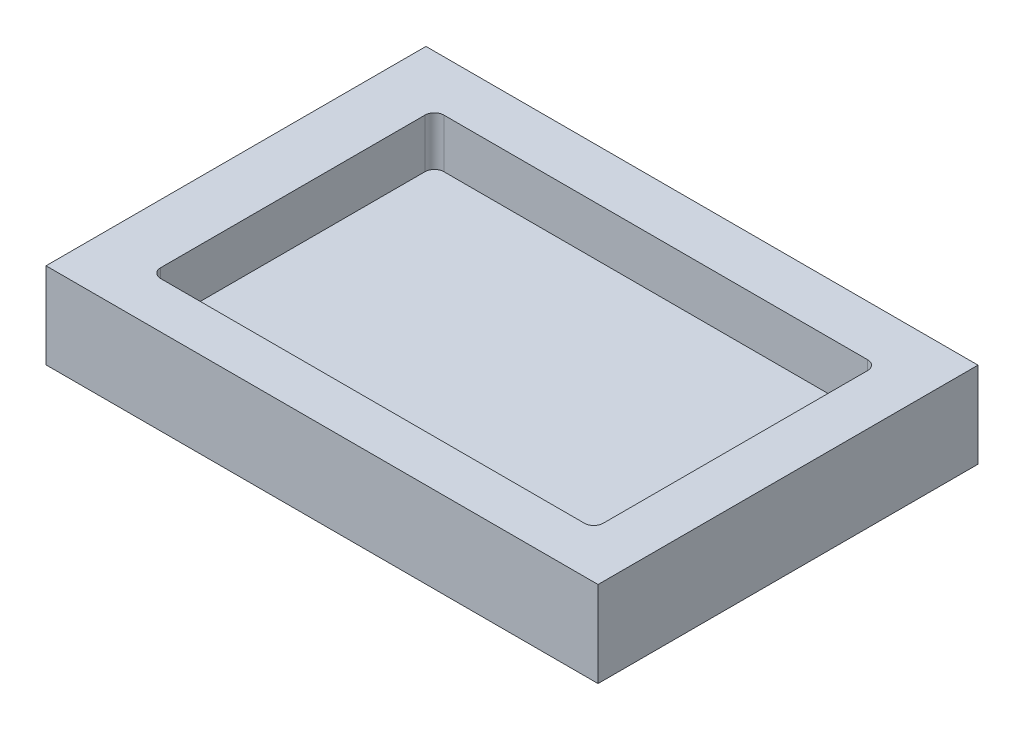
ISO-10303-21;
HEADER;
FILE_DESCRIPTION(('STEP AP214'),'2;1');
FILE_NAME('part.step','',(''),(''),'','','');
FILE_SCHEMA(('AUTOMOTIVE_DESIGN { 1 0 10303 214 1 1 1 1 }'));
ENDSEC;
DATA;
#1=APPLICATION_CONTEXT('core data for automotive mechanical design processes');
#2=APPLICATION_PROTOCOL_DEFINITION('international standard','automotive_design',2000,#1);
#3=PRODUCT_CONTEXT('',#1,'mechanical');
#4=PRODUCT('Part','Part','',(#3));
#5=PRODUCT_RELATED_PRODUCT_CATEGORY('part','',(#4));
#6=PRODUCT_DEFINITION_FORMATION('','',#4);
#7=PRODUCT_DEFINITION_CONTEXT('part definition',#1,'design');
#8=PRODUCT_DEFINITION('design','',#6,#7);
#9=PRODUCT_DEFINITION_SHAPE('','',#8);
#10=(LENGTH_UNIT() NAMED_UNIT(*) SI_UNIT(.MILLI.,.METRE.));
#11=(NAMED_UNIT(*) PLANE_ANGLE_UNIT() SI_UNIT($,.RADIAN.));
#12=(NAMED_UNIT(*) SI_UNIT($,.STERADIAN.) SOLID_ANGLE_UNIT());
#13=UNCERTAINTY_MEASURE_WITH_UNIT(LENGTH_MEASURE(1.E-05),#10,'distance_accuracy_value','');
#14=(GEOMETRIC_REPRESENTATION_CONTEXT(3) GLOBAL_UNCERTAINTY_ASSIGNED_CONTEXT((#13)) GLOBAL_UNIT_ASSIGNED_CONTEXT((#10,
#11,#12)) REPRESENTATION_CONTEXT('',''));
#15=CARTESIAN_POINT('',(0.,0.,0.));
#16=DIRECTION('',(0.,0.,1.));
#17=DIRECTION('',(1.,0.,0.));
#18=AXIS2_PLACEMENT_3D('',#15,#16,#17);
#19=CARTESIAN_POINT('',(-67.9067800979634,23.114,-54.8301366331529));
#20=DIRECTION('',(1.,0.,0.));
#21=DIRECTION('',(0.,0.,-1.));
#22=AXIS2_PLACEMENT_3D('',#19,#20,#21);
#23=PLANE('',#22);
#24=DIRECTION('',(0.,0.,1.));
#25=VECTOR('',#24,1.);
#26=CARTESIAN_POINT('',(-67.9067800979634,0.,-54.8301366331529));
#27=LINE('',#26,#25);
#28=CARTESIAN_POINT('',(-67.9067800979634,0.,-54.8301366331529));
#29=VERTEX_POINT('',#28);
#30=CARTESIAN_POINT('',(-67.9067800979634,0.,47.4888631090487));
#31=VERTEX_POINT('',#30);
#32=EDGE_CURVE('E123',#29,#31,#27,.T.);
#33=ORIENTED_EDGE('',*,*,#32,.T.);
#34=DIRECTION('',(0.,-1.,0.));
#35=VECTOR('',#34,1.);
#36=CARTESIAN_POINT('',(-67.9067800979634,23.114,47.4888631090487));
#37=LINE('',#36,#35);
#38=CARTESIAN_POINT('',(-67.9067800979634,23.114,47.4888631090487));
#39=VERTEX_POINT('',#38);
#40=EDGE_CURVE('E130',#39,#31,#37,.T.);
#41=ORIENTED_EDGE('',*,*,#40,.F.);
#42=DIRECTION('',(0.,0.,1.));
#43=VECTOR('',#42,1.);
#44=CARTESIAN_POINT('',(-67.9067800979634,23.114,-54.8301366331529));
#45=LINE('',#44,#43);
#46=CARTESIAN_POINT('',(-67.9067800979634,23.114,-54.8301366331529));
#47=VERTEX_POINT('',#46);
#48=EDGE_CURVE('E152',#47,#39,#45,.T.);
#49=ORIENTED_EDGE('',*,*,#48,.F.);
#50=DIRECTION('',(0.,-1.,0.));
#51=VECTOR('',#50,1.);
#52=CARTESIAN_POINT('',(-67.9067800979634,23.114,-54.8301366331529));
#53=LINE('',#52,#51);
#54=EDGE_CURVE('E141',#47,#29,#53,.T.);
#55=ORIENTED_EDGE('',*,*,#54,.T.);
#56=EDGE_LOOP('',(#33,#41,#49,#55));
#57=FACE_BOUND('',#56,.T.);
#58=ADVANCED_FACE('F31',(#57),#23,.F.);
#59=CARTESIAN_POINT('',(-67.9067800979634,23.114,47.4888631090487));
#60=DIRECTION('',(0.,0.,-1.));
#61=DIRECTION('',(-1.,0.,0.));
#62=AXIS2_PLACEMENT_3D('',#59,#60,#61);
#63=PLANE('',#62);
#64=DIRECTION('',(1.,0.,0.));
#65=VECTOR('',#64,1.);
#66=CARTESIAN_POINT('',(-67.9067800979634,0.,47.4888631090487));
#67=LINE('',#66,#65);
#68=CARTESIAN_POINT('',(80.7540087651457,0.,47.4888631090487));
#69=VERTEX_POINT('',#68);
#70=EDGE_CURVE('E118',#31,#69,#67,.T.);
#71=ORIENTED_EDGE('',*,*,#70,.T.);
#72=DIRECTION('',(0.,-1.,0.));
#73=VECTOR('',#72,1.);
#74=CARTESIAN_POINT('',(80.7540087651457,23.114,47.4888631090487));
#75=LINE('',#74,#73);
#76=CARTESIAN_POINT('',(80.7540087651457,23.114,47.4888631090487));
#77=VERTEX_POINT('',#76);
#78=EDGE_CURVE('E137',#77,#69,#75,.T.);
#79=ORIENTED_EDGE('',*,*,#78,.F.);
#80=DIRECTION('',(1.,0.,0.));
#81=VECTOR('',#80,1.);
#82=CARTESIAN_POINT('',(-67.9067800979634,23.114,47.4888631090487));
#83=LINE('',#82,#81);
#84=EDGE_CURVE('E132',#39,#77,#83,.T.);
#85=ORIENTED_EDGE('',*,*,#84,.F.);
#86=ORIENTED_EDGE('',*,*,#40,.T.);
#87=EDGE_LOOP('',(#71,#79,#85,#86));
#88=FACE_BOUND('',#87,.T.);
#89=ADVANCED_FACE('F131',(#88),#63,.F.);
#90=CARTESIAN_POINT('',(80.7540087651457,23.114,-54.8301366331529));
#91=DIRECTION('',(-1.,0.,0.));
#92=DIRECTION('',(0.,0.,1.));
#93=AXIS2_PLACEMENT_3D('',#90,#91,#92);
#94=PLANE('',#93);
#95=DIRECTION('',(0.,0.,-1.));
#96=VECTOR('',#95,1.);
#97=CARTESIAN_POINT('',(80.7540087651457,0.,-54.8301366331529));
#98=LINE('',#97,#96);
#99=CARTESIAN_POINT('',(80.7540087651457,0.,-54.8301366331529));
#100=VERTEX_POINT('',#99);
#101=EDGE_CURVE('E124',#69,#100,#98,.T.);
#102=ORIENTED_EDGE('',*,*,#101,.T.);
#103=DIRECTION('',(0.,-1.,0.));
#104=VECTOR('',#103,1.);
#105=CARTESIAN_POINT('',(80.7540087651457,23.114,-54.8301366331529));
#106=LINE('',#105,#104);
#107=CARTESIAN_POINT('',(80.7540087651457,23.114,-54.8301366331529));
#108=VERTEX_POINT('',#107);
#109=EDGE_CURVE('E160',#108,#100,#106,.T.);
#110=ORIENTED_EDGE('',*,*,#109,.F.);
#111=DIRECTION('',(0.,0.,-1.));
#112=VECTOR('',#111,1.);
#113=CARTESIAN_POINT('',(80.7540087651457,23.114,-54.8301366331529));
#114=LINE('',#113,#112);
#115=EDGE_CURVE('E155',#77,#108,#114,.T.);
#116=ORIENTED_EDGE('',*,*,#115,.F.);
#117=ORIENTED_EDGE('',*,*,#78,.T.);
#118=EDGE_LOOP('',(#102,#110,#116,#117));
#119=FACE_BOUND('',#118,.T.);
#120=ADVANCED_FACE('F256',(#119),#94,.F.);
#121=CARTESIAN_POINT('',(-67.9067800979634,23.114,-54.8301366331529));
#122=DIRECTION('',(0.,0.,1.));
#123=DIRECTION('',(1.,0.,0.));
#124=AXIS2_PLACEMENT_3D('',#121,#122,#123);
#125=PLANE('',#124);
#126=DIRECTION('',(-1.,0.,0.));
#127=VECTOR('',#126,1.);
#128=CARTESIAN_POINT('',(-67.9067800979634,0.,-54.8301366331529));
#129=LINE('',#128,#127);
#130=EDGE_CURVE('E150',#100,#29,#129,.T.);
#131=ORIENTED_EDGE('',*,*,#130,.T.);
#132=ORIENTED_EDGE('',*,*,#54,.F.);
#133=DIRECTION('',(-1.,0.,0.));
#134=VECTOR('',#133,1.);
#135=CARTESIAN_POINT('',(-67.9067800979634,23.114,-54.8301366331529));
#136=LINE('',#135,#134);
#137=EDGE_CURVE('E157',#108,#47,#136,.T.);
#138=ORIENTED_EDGE('',*,*,#137,.F.);
#139=ORIENTED_EDGE('',*,*,#109,.T.);
#140=EDGE_LOOP('',(#131,#132,#138,#139));
#141=FACE_BOUND('',#140,.T.);
#142=ADVANCED_FACE('F260',(#141),#125,.F.);
#143=CARTESIAN_POINT('',(-67.9067800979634,23.114,47.4888631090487));
#144=DIRECTION('',(0.,1.,0.));
#145=DIRECTION('',(0.,0.,1.));
#146=AXIS2_PLACEMENT_3D('',#143,#144,#145);
#147=PLANE('',#146);
#148=DIRECTION('',(0.,0.,-1.));
#149=VECTOR('',#148,1.);
#150=CARTESIAN_POINT('',(67.1679686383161,23.114,-41.2286602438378));
#151=LINE('',#150,#149);
#152=CARTESIAN_POINT('',(67.1679686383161,23.114,32.4971221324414));
#153=VERTEX_POINT('',#152);
#154=CARTESIAN_POINT('',(67.1679686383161,23.114,-38.6886602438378));
#155=VERTEX_POINT('',#154);
#156=EDGE_CURVE('E199',#153,#155,#151,.T.);
#157=ORIENTED_EDGE('',*,*,#156,.F.);
#158=CARTESIAN_POINT('',(64.6279686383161,23.114,32.4971221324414));
#159=DIRECTION('',(0.,1.,0.));
#160=DIRECTION('',(0.,0.,1.));
#161=AXIS2_PLACEMENT_3D('',#158,#159,#160);
#162=CIRCLE('',#161,2.54);
#163=CARTESIAN_POINT('',(64.6279686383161,23.114,35.0371221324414));
#164=VERTEX_POINT('',#163);
#165=EDGE_CURVE('E192',#153,#164,#162,.F.);
#166=ORIENTED_EDGE('',*,*,#165,.T.);
#167=DIRECTION('',(1.,0.,0.));
#168=VECTOR('',#167,1.);
#169=CARTESIAN_POINT('',(67.1679686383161,23.114,35.0371221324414));
#170=LINE('',#169,#168);
#171=CARTESIAN_POINT('',(-49.4812691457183,23.114,35.0371221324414));
#172=VERTEX_POINT('',#171);
#173=EDGE_CURVE('E197',#172,#164,#170,.T.);
#174=ORIENTED_EDGE('',*,*,#173,.F.);
#175=CARTESIAN_POINT('',(-49.4812691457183,23.114,32.4971221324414));
#176=DIRECTION('',(0.,1.,0.));
#177=DIRECTION('',(0.,0.,1.));
#178=AXIS2_PLACEMENT_3D('',#175,#176,#177);
#179=CIRCLE('',#178,2.54);
#180=CARTESIAN_POINT('',(-52.0212691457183,23.114,32.4971221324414));
#181=VERTEX_POINT('',#180);
#182=EDGE_CURVE('E38',#172,#181,#179,.F.);
#183=ORIENTED_EDGE('',*,*,#182,.T.);
#184=DIRECTION('',(0.,0.,1.));
#185=VECTOR('',#184,1.);
#186=CARTESIAN_POINT('',(-52.0212691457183,23.114,-41.2286602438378));
#187=LINE('',#186,#185);
#188=CARTESIAN_POINT('',(-52.0212691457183,23.114,-38.6886602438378));
#189=VERTEX_POINT('',#188);
#190=EDGE_CURVE('E208',#189,#181,#187,.T.);
#191=ORIENTED_EDGE('',*,*,#190,.F.);
#192=CARTESIAN_POINT('',(-49.4812691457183,23.114,-38.6886602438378));
#193=DIRECTION('',(0.,1.,0.));
#194=DIRECTION('',(0.,0.,1.));
#195=AXIS2_PLACEMENT_3D('',#192,#193,#194);
#196=CIRCLE('',#195,2.54);
#197=CARTESIAN_POINT('',(-49.4812691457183,23.114,-41.2286602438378));
#198=VERTEX_POINT('',#197);
#199=EDGE_CURVE('E11',#189,#198,#196,.F.);
#200=ORIENTED_EDGE('',*,*,#199,.T.);
#201=DIRECTION('',(-1.,0.,0.));
#202=VECTOR('',#201,1.);
#203=CARTESIAN_POINT('',(67.1679686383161,23.114,-41.2286602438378));
#204=LINE('',#203,#202);
#205=CARTESIAN_POINT('',(64.6279686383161,23.114,-41.2286602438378));
#206=VERTEX_POINT('',#205);
#207=EDGE_CURVE('E234',#206,#198,#204,.T.);
#208=ORIENTED_EDGE('',*,*,#207,.F.);
#209=CARTESIAN_POINT('',(64.6279686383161,23.114,-38.6886602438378));
#210=DIRECTION('',(0.,1.,0.));
#211=DIRECTION('',(0.,0.,1.));
#212=AXIS2_PLACEMENT_3D('',#209,#210,#211);
#213=CIRCLE('',#212,2.54);
#214=EDGE_CURVE('E190',#206,#155,#213,.F.);
#215=ORIENTED_EDGE('',*,*,#214,.T.);
#216=EDGE_LOOP('',(#157,#166,#174,#183,#191,#200,#208,#215));
#217=FACE_BOUND('',#216,.T.);
#218=ORIENTED_EDGE('',*,*,#48,.T.);
#219=ORIENTED_EDGE('',*,*,#84,.T.);
#220=ORIENTED_EDGE('',*,*,#115,.T.);
#221=ORIENTED_EDGE('',*,*,#137,.T.);
#222=EDGE_LOOP('',(#218,#219,#220,#221));
#223=FACE_BOUND('',#222,.T.);
#224=ADVANCED_FACE('F195',(#217,#223),#147,.T.);
#225=CARTESIAN_POINT('',(-67.9067800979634,0.,47.4888631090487));
#226=DIRECTION('',(0.,1.,0.));
#227=DIRECTION('',(0.,0.,1.));
#228=AXIS2_PLACEMENT_3D('',#225,#226,#227);
#229=PLANE('',#228);
#230=ORIENTED_EDGE('',*,*,#32,.F.);
#231=ORIENTED_EDGE('',*,*,#130,.F.);
#232=ORIENTED_EDGE('',*,*,#101,.F.);
#233=ORIENTED_EDGE('',*,*,#70,.F.);
#234=EDGE_LOOP('',(#230,#231,#232,#233));
#235=FACE_BOUND('',#234,.T.);
#236=ADVANCED_FACE('F120',(#235),#229,.F.);
#237=CARTESIAN_POINT('',(67.1679686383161,9.90600000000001,-41.2286602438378));
#238=DIRECTION('',(1.,0.,0.));
#239=DIRECTION('',(0.,0.,-1.));
#240=AXIS2_PLACEMENT_3D('',#237,#238,#239);
#241=PLANE('',#240);
#242=ORIENTED_EDGE('',*,*,#156,.T.);
#243=DIRECTION('',(0.,1.,0.));
#244=VECTOR('',#243,1.);
#245=CARTESIAN_POINT('',(67.1679686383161,9.90600000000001,-38.6886602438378));
#246=LINE('',#245,#244);
#247=CARTESIAN_POINT('',(67.1679686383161,9.90600000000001,-38.6886602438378));
#248=VERTEX_POINT('',#247);
#249=EDGE_CURVE('E171',#155,#248,#246,.F.);
#250=ORIENTED_EDGE('',*,*,#249,.T.);
#251=DIRECTION('',(0.,0.,-1.));
#252=VECTOR('',#251,1.);
#253=CARTESIAN_POINT('',(67.1679686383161,9.90600000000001,-41.2286602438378));
#254=LINE('',#253,#252);
#255=CARTESIAN_POINT('',(67.1679686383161,9.90600000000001,32.4971221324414));
#256=VERTEX_POINT('',#255);
#257=EDGE_CURVE('E207',#256,#248,#254,.T.);
#258=ORIENTED_EDGE('',*,*,#257,.F.);
#259=DIRECTION('',(0.,1.,0.));
#260=VECTOR('',#259,1.);
#261=CARTESIAN_POINT('',(67.1679686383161,23.114,32.4971221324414));
#262=LINE('',#261,#260);
#263=EDGE_CURVE('E168',#256,#153,#262,.T.);
#264=ORIENTED_EDGE('',*,*,#263,.T.);
#265=EDGE_LOOP('',(#242,#250,#258,#264));
#266=FACE_BOUND('',#265,.T.);
#267=ADVANCED_FACE('F218',(#266),#241,.F.);
#268=CARTESIAN_POINT('',(67.1679686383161,9.90600000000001,35.0371221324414));
#269=DIRECTION('',(0.,0.,1.));
#270=DIRECTION('',(1.,0.,0.));
#271=AXIS2_PLACEMENT_3D('',#268,#269,#270);
#272=PLANE('',#271);
#273=ORIENTED_EDGE('',*,*,#173,.T.);
#274=DIRECTION('',(0.,1.,0.));
#275=VECTOR('',#274,1.);
#276=CARTESIAN_POINT('',(64.6279686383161,9.90600000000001,35.0371221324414));
#277=LINE('',#276,#275);
#278=CARTESIAN_POINT('',(64.6279686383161,9.90600000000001,35.0371221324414));
#279=VERTEX_POINT('',#278);
#280=EDGE_CURVE('E184',#164,#279,#277,.F.);
#281=ORIENTED_EDGE('',*,*,#280,.T.);
#282=DIRECTION('',(1.,0.,0.));
#283=VECTOR('',#282,1.);
#284=CARTESIAN_POINT('',(67.1679686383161,9.90600000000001,35.0371221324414));
#285=LINE('',#284,#283);
#286=CARTESIAN_POINT('',(-49.4812691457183,9.90600000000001,35.0371221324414));
#287=VERTEX_POINT('',#286);
#288=EDGE_CURVE('E142',#287,#279,#285,.T.);
#289=ORIENTED_EDGE('',*,*,#288,.F.);
#290=DIRECTION('',(0.,1.,0.));
#291=VECTOR('',#290,1.);
#292=CARTESIAN_POINT('',(-49.4812691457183,23.114,35.0371221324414));
#293=LINE('',#292,#291);
#294=EDGE_CURVE('E181',#287,#172,#293,.T.);
#295=ORIENTED_EDGE('',*,*,#294,.T.);
#296=EDGE_LOOP('',(#273,#281,#289,#295));
#297=FACE_BOUND('',#296,.T.);
#298=ADVANCED_FACE('F204',(#297),#272,.F.);
#299=CARTESIAN_POINT('',(-52.0212691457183,9.90600000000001,-41.2286602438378));
#300=DIRECTION('',(-1.,0.,0.));
#301=DIRECTION('',(0.,0.,1.));
#302=AXIS2_PLACEMENT_3D('',#299,#300,#301);
#303=PLANE('',#302);
#304=ORIENTED_EDGE('',*,*,#190,.T.);
#305=DIRECTION('',(0.,1.,0.));
#306=VECTOR('',#305,1.);
#307=CARTESIAN_POINT('',(-52.0212691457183,9.90600000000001,32.4971221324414));
#308=LINE('',#307,#306);
#309=CARTESIAN_POINT('',(-52.0212691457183,9.90600000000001,32.4971221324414));
#310=VERTEX_POINT('',#309);
#311=EDGE_CURVE('E188',#181,#310,#308,.F.);
#312=ORIENTED_EDGE('',*,*,#311,.T.);
#313=DIRECTION('',(0.,0.,1.));
#314=VECTOR('',#313,1.);
#315=CARTESIAN_POINT('',(-52.0212691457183,9.90600000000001,-41.2286602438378));
#316=LINE('',#315,#314);
#317=CARTESIAN_POINT('',(-52.0212691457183,9.90600000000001,-38.6886602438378));
#318=VERTEX_POINT('',#317);
#319=EDGE_CURVE('E145',#318,#310,#316,.T.);
#320=ORIENTED_EDGE('',*,*,#319,.F.);
#321=DIRECTION('',(0.,1.,0.));
#322=VECTOR('',#321,1.);
#323=CARTESIAN_POINT('',(-52.0212691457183,23.114,-38.6886602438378));
#324=LINE('',#323,#322);
#325=EDGE_CURVE('E186',#318,#189,#324,.T.);
#326=ORIENTED_EDGE('',*,*,#325,.T.);
#327=EDGE_LOOP('',(#304,#312,#320,#326));
#328=FACE_BOUND('',#327,.T.);
#329=ADVANCED_FACE('F233',(#328),#303,.F.);
#330=CARTESIAN_POINT('',(67.1679686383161,9.90600000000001,-41.2286602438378));
#331=DIRECTION('',(0.,0.,-1.));
#332=DIRECTION('',(-1.,0.,0.));
#333=AXIS2_PLACEMENT_3D('',#330,#331,#332);
#334=PLANE('',#333);
#335=DIRECTION('',(-1.,0.,0.));
#336=VECTOR('',#335,1.);
#337=CARTESIAN_POINT('',(67.1679686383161,9.90600000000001,-41.2286602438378));
#338=LINE('',#337,#336);
#339=CARTESIAN_POINT('',(64.6279686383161,9.90600000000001,-41.2286602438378));
#340=VERTEX_POINT('',#339);
#341=CARTESIAN_POINT('',(-49.4812691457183,9.90600000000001,-41.2286602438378));
#342=VERTEX_POINT('',#341);
#343=EDGE_CURVE('E220',#340,#342,#338,.T.);
#344=ORIENTED_EDGE('',*,*,#343,.F.);
#345=DIRECTION('',(0.,1.,0.));
#346=VECTOR('',#345,1.);
#347=CARTESIAN_POINT('',(64.6279686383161,23.114,-41.2286602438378));
#348=LINE('',#347,#346);
#349=EDGE_CURVE('E165',#340,#206,#348,.T.);
#350=ORIENTED_EDGE('',*,*,#349,.T.);
#351=ORIENTED_EDGE('',*,*,#207,.T.);
#352=DIRECTION('',(0.,1.,0.));
#353=VECTOR('',#352,1.);
#354=CARTESIAN_POINT('',(-49.4812691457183,9.90600000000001,-41.2286602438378));
#355=LINE('',#354,#353);
#356=EDGE_CURVE('E136',#198,#342,#355,.F.);
#357=ORIENTED_EDGE('',*,*,#356,.T.);
#358=EDGE_LOOP('',(#344,#350,#351,#357));
#359=FACE_BOUND('',#358,.T.);
#360=ADVANCED_FACE('F243',(#359),#334,.F.);
#361=CARTESIAN_POINT('',(67.1679686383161,9.90600000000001,35.0371221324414));
#362=DIRECTION('',(0.,-1.,0.));
#363=DIRECTION('',(0.,0.,-1.));
#364=AXIS2_PLACEMENT_3D('',#361,#362,#363);
#365=PLANE('',#364);
#366=ORIENTED_EDGE('',*,*,#257,.T.);
#367=CARTESIAN_POINT('',(64.6279686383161,9.90600000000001,-38.6886602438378));
#368=DIRECTION('',(0.,-1.,0.));
#369=DIRECTION('',(0.,0.,-1.));
#370=AXIS2_PLACEMENT_3D('',#367,#368,#369);
#371=CIRCLE('',#370,2.54);
#372=EDGE_CURVE('E179',#248,#340,#371,.F.);
#373=ORIENTED_EDGE('',*,*,#372,.T.);
#374=ORIENTED_EDGE('',*,*,#343,.T.);
#375=CARTESIAN_POINT('',(-49.4812691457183,9.90600000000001,-38.6886602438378));
#376=DIRECTION('',(0.,-1.,0.));
#377=DIRECTION('',(0.,0.,-1.));
#378=AXIS2_PLACEMENT_3D('',#375,#376,#377);
#379=CIRCLE('',#378,2.54);
#380=EDGE_CURVE('E173',#342,#318,#379,.F.);
#381=ORIENTED_EDGE('',*,*,#380,.T.);
#382=ORIENTED_EDGE('',*,*,#319,.T.);
#383=CARTESIAN_POINT('',(-49.4812691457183,9.90600000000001,32.4971221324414));
#384=DIRECTION('',(0.,-1.,0.));
#385=DIRECTION('',(0.,0.,-1.));
#386=AXIS2_PLACEMENT_3D('',#383,#384,#385);
#387=CIRCLE('',#386,2.54);
#388=EDGE_CURVE('E175',#310,#287,#387,.F.);
#389=ORIENTED_EDGE('',*,*,#388,.T.);
#390=ORIENTED_EDGE('',*,*,#288,.T.);
#391=CARTESIAN_POINT('',(64.6279686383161,9.90600000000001,32.4971221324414));
#392=DIRECTION('',(0.,-1.,0.));
#393=DIRECTION('',(0.,0.,-1.));
#394=AXIS2_PLACEMENT_3D('',#391,#392,#393);
#395=CIRCLE('',#394,2.54);
#396=EDGE_CURVE('E177',#279,#256,#395,.F.);
#397=ORIENTED_EDGE('',*,*,#396,.T.);
#398=EDGE_LOOP('',(#366,#373,#374,#381,#382,#389,#390,#397));
#399=FACE_BOUND('',#398,.T.);
#400=ADVANCED_FACE('F215',(#399),#365,.F.);
#401=CARTESIAN_POINT('',(64.6279686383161,9.90600000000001,-38.6886602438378));
#402=DIRECTION('',(0.,-1.,0.));
#403=DIRECTION('',(0.,0.,-1.));
#404=AXIS2_PLACEMENT_3D('',#401,#402,#403);
#405=CYLINDRICAL_SURFACE('',#404,2.54);
#406=ORIENTED_EDGE('',*,*,#372,.F.);
#407=ORIENTED_EDGE('',*,*,#249,.F.);
#408=ORIENTED_EDGE('',*,*,#214,.F.);
#409=ORIENTED_EDGE('',*,*,#349,.F.);
#410=EDGE_LOOP('',(#406,#407,#408,#409));
#411=FACE_BOUND('',#410,.T.);
#412=ADVANCED_FACE('F239',(#411),#405,.F.);
#413=CARTESIAN_POINT('',(64.6279686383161,9.90600000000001,32.4971221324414));
#414=DIRECTION('',(0.,-1.,0.));
#415=DIRECTION('',(0.,0.,-1.));
#416=AXIS2_PLACEMENT_3D('',#413,#414,#415);
#417=CYLINDRICAL_SURFACE('',#416,2.54);
#418=ORIENTED_EDGE('',*,*,#396,.F.);
#419=ORIENTED_EDGE('',*,*,#280,.F.);
#420=ORIENTED_EDGE('',*,*,#165,.F.);
#421=ORIENTED_EDGE('',*,*,#263,.F.);
#422=EDGE_LOOP('',(#418,#419,#420,#421));
#423=FACE_BOUND('',#422,.T.);
#424=ADVANCED_FACE('F211',(#423),#417,.F.);
#425=CARTESIAN_POINT('',(-49.4812691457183,9.90600000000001,32.4971221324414));
#426=DIRECTION('',(0.,-1.,0.));
#427=DIRECTION('',(0.,0.,-1.));
#428=AXIS2_PLACEMENT_3D('',#425,#426,#427);
#429=CYLINDRICAL_SURFACE('',#428,2.54);
#430=ORIENTED_EDGE('',*,*,#388,.F.);
#431=ORIENTED_EDGE('',*,*,#311,.F.);
#432=ORIENTED_EDGE('',*,*,#182,.F.);
#433=ORIENTED_EDGE('',*,*,#294,.F.);
#434=EDGE_LOOP('',(#430,#431,#432,#433));
#435=FACE_BOUND('',#434,.T.);
#436=ADVANCED_FACE('F232',(#435),#429,.F.);
#437=CARTESIAN_POINT('',(-49.4812691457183,9.90600000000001,-38.6886602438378));
#438=DIRECTION('',(0.,-1.,0.));
#439=DIRECTION('',(0.,0.,-1.));
#440=AXIS2_PLACEMENT_3D('',#437,#438,#439);
#441=CYLINDRICAL_SURFACE('',#440,2.54);
#442=ORIENTED_EDGE('',*,*,#380,.F.);
#443=ORIENTED_EDGE('',*,*,#356,.F.);
#444=ORIENTED_EDGE('',*,*,#199,.F.);
#445=ORIENTED_EDGE('',*,*,#325,.F.);
#446=EDGE_LOOP('',(#442,#443,#444,#445));
#447=FACE_BOUND('',#446,.T.);
#448=ADVANCED_FACE('F245',(#447),#441,.F.);
#449=CLOSED_SHELL('',(#58,#89,#120,#142,#224,#236,#267,#298,#329,#360,#400,#412,#424,#436,#448));
#450=MANIFOLD_SOLID_BREP('B2',#449);
#451=ADVANCED_BREP_SHAPE_REPRESENTATION('',(#18,#450),#14);
#452=SHAPE_DEFINITION_REPRESENTATION(#9,#451);
ENDSEC;
END-ISO-10303-21;
